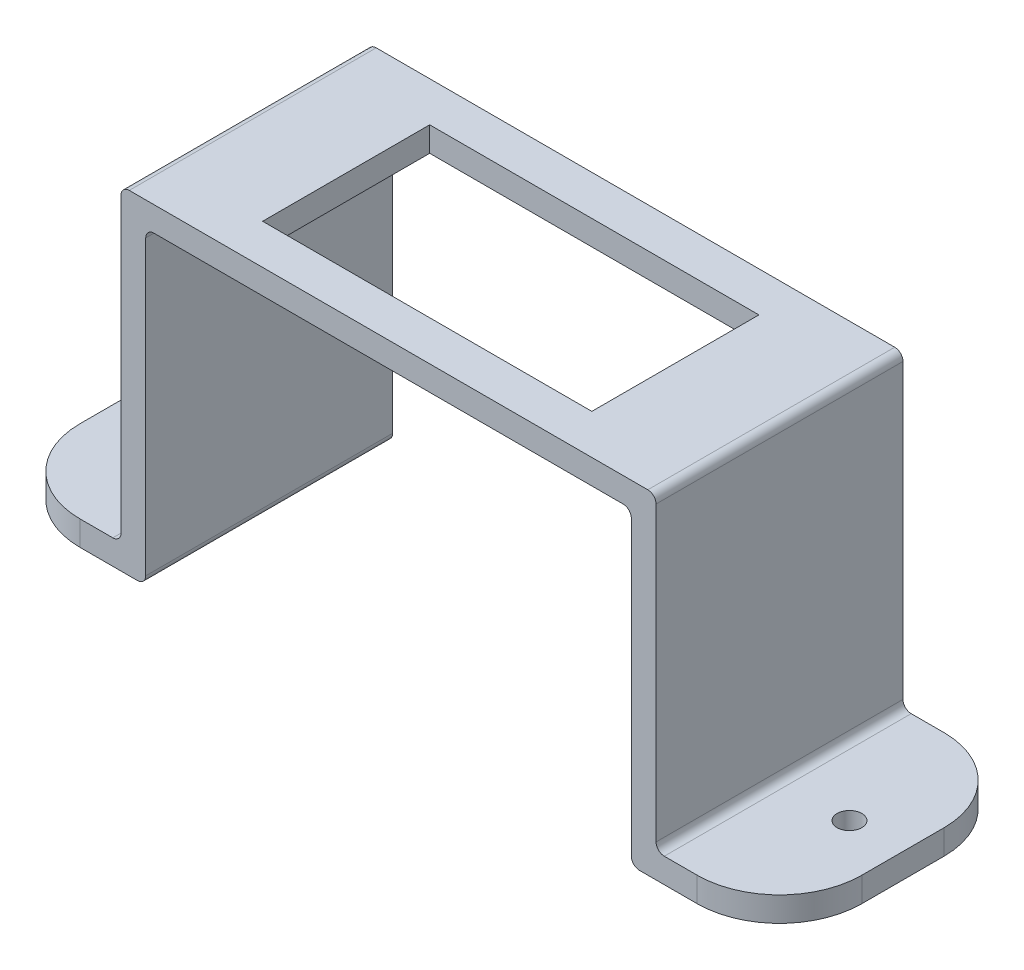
from build123d import *

# Parameters (mm, degrees)
EXTRU_MINCE1_DEPTH = 30
ESQUISSE2_R        = 1.5
EXTRUSION1_DEPTH   = 3
ESQUISSE3_W        = 40
ESQUISSE3_H        = 20.3
EXTRUSION2_DEPTH   = 30
CONG_5_R           = 1
CONG_6_R           = 1
CONG_7_R           = 1
CONG_8_R           = 1
CONG_9_R           = 1
CONG_10_R          = 10
CONG_11_R          = 10


with BuildPart() as part:
    # Esquisse1 → Extru.-Mince1 (new body)
    with BuildSketch(Plane.XY):
        Polygon((0, 0), (15, 0), (15, 37.555714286), (80, 37.555714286), (80, 0), (95, 0), (95, -3), (77, -3), (77, 34.555714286), (18, 34.555714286), (18, -3), (0, -3), align=None)
    extrude(amount=EXTRU_MINCE1_DEPTH)

    # Esquisse2 → Extrusion1 (cut)
    with BuildSketch(Plane(origin=(0, 0, 0), x_dir=(1, 0, 0), z_dir=(0, 1, 0))):
        with Locations(Location((88.5, -15, 0), (0, 0, 270))):
            Circle(ESQUISSE2_R)
        with Locations(Location((7.5, -15, 0), (0, 0, 270))):
            Circle(ESQUISSE2_R)
    extrude(amount=-EXTRUSION1_DEPTH, mode=Mode.SUBTRACT)

    # Esquisse3 → Extrusion2 (cut)
    with BuildSketch(Plane(origin=(0, 37.555714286, 0), x_dir=(1, 0, 0), z_dir=(0, 1, 0))):
        with Locations((47.35, -15)):
            Rectangle(ESQUISSE3_W, ESQUISSE3_H)
    extrude(amount=-EXTRUSION2_DEPTH, mode=Mode.SUBTRACT)

    # Cong_5
    cong_5_edges = [part.edges().sort_by_distance(p)[0] for p in [
        (15, 37.555714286, 15),
        (80, 37.555714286, 15),
    ]]
    fillet(cong_5_edges, radius=CONG_5_R)

    # Cong_6
    cong_6_edges = [part.edges().sort_by_distance(p)[0] for p in [
        (77, -3, 15),
        (77, 34.555714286, 15),
    ]]
    fillet(cong_6_edges, radius=CONG_6_R)

    # Cong_7
    cong_7_edges = [part.edges().sort_by_distance(p)[0] for p in [
        (18, 34.555714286, 15),
        (18, -3, 15),
    ]]
    fillet(cong_7_edges, radius=CONG_7_R)

    # Cong_8
    cong_8_edges = [part.edges().sort_by_distance(p)[0] for p in [
        (80, 0, 15),
    ]]
    fillet(cong_8_edges, radius=CONG_8_R)

    # Cong_9
    cong_9_edges = [part.edges().sort_by_distance(p)[0] for p in [
        (15, 0, 15),
    ]]
    fillet(cong_9_edges, radius=CONG_9_R)

    # Cong_10
    cong_10_edges = [part.edges().sort_by_distance(p)[0] for p in [
        (0, -1.5, 30),
        (95, -1.5, 30),
    ]]
    fillet(cong_10_edges, radius=CONG_10_R)

    # Cong_11
    cong_11_edges = [part.edges().sort_by_distance(p)[0] for p in [
        (0, -1.5, 0),
        (95, -1.5, 0),
    ]]
    fillet(cong_11_edges, radius=CONG_11_R)


solid = part.part
